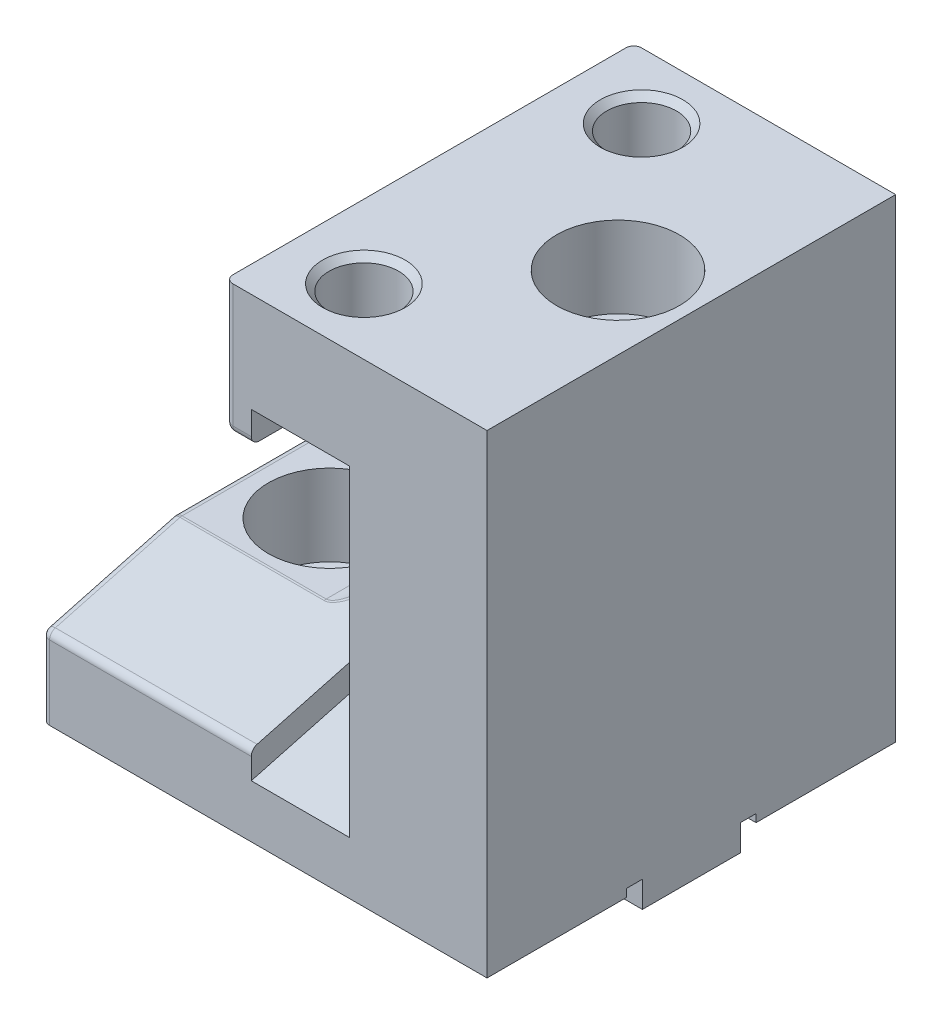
from build123d import *

# Parameters (mm, degrees)
EXTRUDE1_DEPTH                                      = 79.248
EXTRUDE2_DEPTH                                      = 19.05
EXTRUDE3_DEPTH                                      = 5.08
EXTRUDE4_DEPTH                                      = 35.56
SKETCH5_W                                           = 18.9865
SKETCH5_H                                           = 3.556
EXTRUDE5_DEPTH                                      = 86.36
SKETCH6_W                                           = 3.048
SKETCH6_H                                           = 1.524
EXTRUDE6_DEPTH                                      = 149.972245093
CBORE_FOR_5_8_SOCKET_HEAD_CAP_SCREW1_D              = 15.875
CBORE_FOR_5_8_SOCKET_HEAD_CAP_SCREW1_CBORE_D        = 23.8252
CBORE_FOR_5_8_SOCKET_HEAD_CAP_SCREW1_CBORE_DEPTH    = 15.748
CBORE_FOR_5_8_SOCKET_HEAD_CAP_SCREW1_ON_D           = 15.875
CBORE_FOR_5_8_SOCKET_HEAD_CAP_SCREW1_ON_CBORE_D     = 23.8252
CBORE_FOR_5_8_SOCKET_HEAD_CAP_SCREW1_ON_CBORE_DEPTH = 15.748
F_5_8_11_TAPPED_HOLE1_D                             = 13.49248
F_5_8_11_TAPPED_HOLE1_DEPTH                         = 19.304
F_5_8_11_TAPPED_HOLE1_CSINK_D                       = 16.002
F_5_8_11_TAPPED_HOLE1_CSINK_ANGLE                   = 90
FILLET1_R                                           = 6.096
FILLET2_R                                           = 1.524


with BuildPart() as part:
    # Sketch1 → Extrude1 (new body)
    with BuildSketch(Plane.XY):
        Polygon((0, 0), (0, 91.948), (-50.8, 91.948), (-50.8, 66.548), (-45.72, 66.548), (-45.72, 72.644), (-26.67, 72.644), (-26.67, 0), align=None)
    extrude(amount=EXTRUDE1_DEPTH)

    # Sketch2 → Extrude2 (add)
    with BuildSketch(Plane.ZY.offset(26.67)):
        Polygon((0, 0), (0, 31.496), (79.248, 10.261562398), (79.248, 0), align=None)
    extrude(amount=EXTRUDE2_DEPTH)

    # Sketch3 → Extrude3 (add)
    with BuildSketch(Plane.ZY.offset(45.72)):
        Polygon((0, 36.755202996), (0, 0), (79.248, 0), (79.248, 15.520765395), align=None)
    extrude(amount=EXTRUDE3_DEPTH)

    # Sketch4 → Extrude4 (add)
    with BuildSketch(Plane.ZY.offset(50.8)):
        Polygon((0, 0), (0, 22.352), (53.753485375, 22.352), (79.248, 15.520765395), (79.248, 0), align=None)
    extrude(amount=EXTRUDE4_DEPTH)

    # Sketch5 → Extrude5 (add, through all)
    with BuildSketch(Plane.ZY.offset(86.36)):
        with Locations((39.624, -1.778)):
            Rectangle(SKETCH5_W, SKETCH5_H)
    extrude(amount=-EXTRUDE5_DEPTH)

    # Sketch6 → Extrude6 (cut, through all)
    with BuildSketch(Plane.ZY.offset(86.36)):
        with Locations((50.64125, 0.762)):
            Rectangle(SKETCH6_W, SKETCH6_H)
        with Locations((28.60675, 0.762)):
            Rectangle(SKETCH6_W, SKETCH6_H)
    extrude(amount=-EXTRUDE6_DEPTH, mode=Mode.SUBTRACT)

    # CBORE for 5_8 Socket Head Cap Screw1 (through all)
    with Locations(Plane(origin=(-14.224, 91.948, 39.624), x_dir=(1, 0, 0), z_dir=(0, 1, 0))):
        with Locations((0, 0)):
            CounterBoreHole(CBORE_FOR_5_8_SOCKET_HEAD_CAP_SCREW1_D / 2, CBORE_FOR_5_8_SOCKET_HEAD_CAP_SCREW1_CBORE_D / 2, CBORE_FOR_5_8_SOCKET_HEAD_CAP_SCREW1_CBORE_DEPTH)

    # CBORE for 5_8 Socket Head Cap Screw1 on (through all)
    with Locations(Plane(origin=(-70.104, 22.352, 39.624), x_dir=(0, 0, 1), z_dir=(0, 1, 0))):
        with Locations((0, 0)):
            CounterBoreHole(CBORE_FOR_5_8_SOCKET_HEAD_CAP_SCREW1_ON_D / 2, CBORE_FOR_5_8_SOCKET_HEAD_CAP_SCREW1_ON_CBORE_D / 2, CBORE_FOR_5_8_SOCKET_HEAD_CAP_SCREW1_ON_CBORE_DEPTH)

    # 5_8-11 Tapped Hole1
    with Locations(Plane(origin=(0, 91.948, 0), x_dir=(-1, 0, 0), z_dir=(0, 1, 0))):
        with Locations((36.576, 12.7), (36.576, 66.548)):
            CounterSinkHole(F_5_8_11_TAPPED_HOLE1_D / 2, F_5_8_11_TAPPED_HOLE1_CSINK_D / 2, depth=F_5_8_11_TAPPED_HOLE1_DEPTH, counter_sink_angle=F_5_8_11_TAPPED_HOLE1_CSINK_ANGLE)

    # Fillet1
    fillet1_edges = [part.edges().sort_by_distance(p)[0] for p in [
        (-50.8, 22.352, 26.876742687),
    ]]
    fillet(fillet1_edges, radius=FILLET1_R)

    # Fillet2
    fillet2_edges = [part.edges().sort_by_distance(p)[0] for p in [
        (-50.8, 32.601601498, 0),
        (-52.585477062, 24.137477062, 0),
        (-51.750091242, 25.179844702, 43.199825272),
        (-86.36, 11.176, 0),
        (-71.628, 22.352, 53.753485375),
        (-86.36, 22.352, 26.876742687),
        (-86.36, 18.936382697, 66.500742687),
        (-66.04, 15.520765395, 79.248),
        (-86.36, 7.760382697, 79.248),
        (-48.26, 66.548, 0),
        (-48.26, 66.548, 79.248),
        (-50.8, 66.548, 39.624),
        (-50.8, 79.248, 0),
        (-50.8, 79.248, 79.248),
        (-48.26, 36.755202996, 0),
        (-71.628, 22.352, 0),
        (-50.8, 32.601601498, 15.501451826),
    ]]
    fillet(fillet2_edges, radius=FILLET2_R)


solid = part.part
